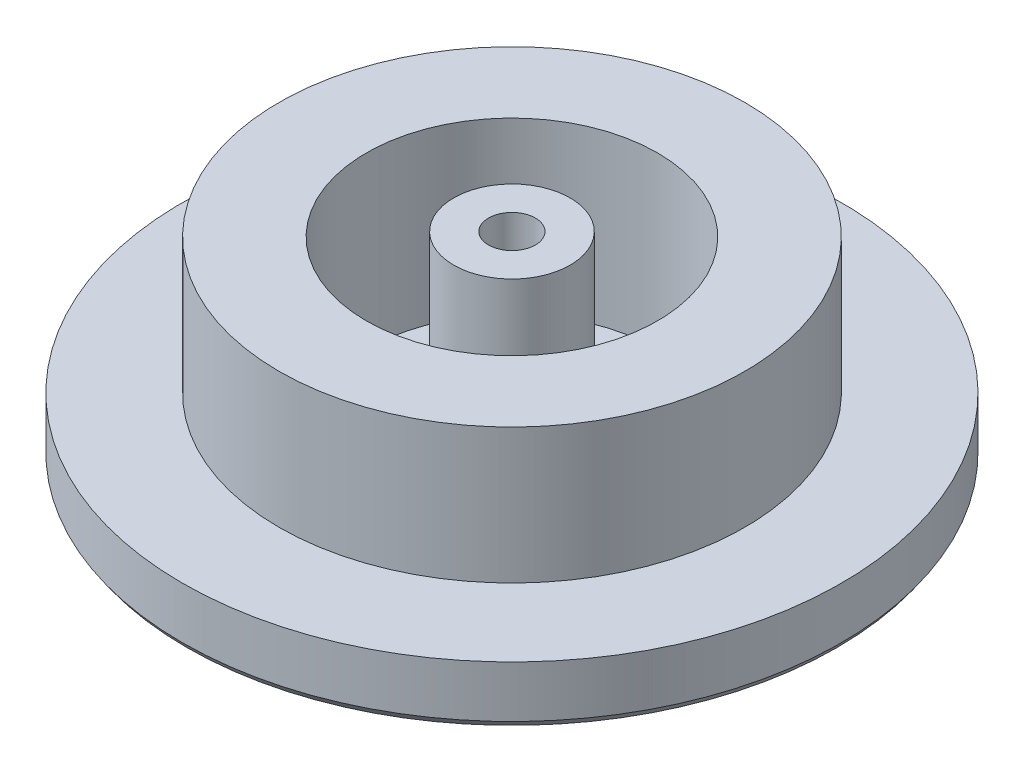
ISO-10303-21;
HEADER;
FILE_DESCRIPTION(('STEP AP214'),'2;1');
FILE_NAME('part.step','',(''),(''),'','','');
FILE_SCHEMA(('AUTOMOTIVE_DESIGN { 1 0 10303 214 1 1 1 1 }'));
ENDSEC;
DATA;
#1=APPLICATION_CONTEXT('core data for automotive mechanical design processes');
#2=APPLICATION_PROTOCOL_DEFINITION('international standard','automotive_design',2000,#1);
#3=PRODUCT_CONTEXT('',#1,'mechanical');
#4=PRODUCT('Part','Part','',(#3));
#5=PRODUCT_RELATED_PRODUCT_CATEGORY('part','',(#4));
#6=PRODUCT_DEFINITION_FORMATION('','',#4);
#7=PRODUCT_DEFINITION_CONTEXT('part definition',#1,'design');
#8=PRODUCT_DEFINITION('design','',#6,#7);
#9=PRODUCT_DEFINITION_SHAPE('','',#8);
#10=(LENGTH_UNIT() NAMED_UNIT(*) SI_UNIT(.MILLI.,.METRE.));
#11=(NAMED_UNIT(*) PLANE_ANGLE_UNIT() SI_UNIT($,.RADIAN.));
#12=(NAMED_UNIT(*) SI_UNIT($,.STERADIAN.) SOLID_ANGLE_UNIT());
#13=UNCERTAINTY_MEASURE_WITH_UNIT(LENGTH_MEASURE(1.E-05),#10,'distance_accuracy_value','');
#14=(GEOMETRIC_REPRESENTATION_CONTEXT(3) GLOBAL_UNCERTAINTY_ASSIGNED_CONTEXT((#13)) GLOBAL_UNIT_ASSIGNED_CONTEXT((#10,
#11,#12)) REPRESENTATION_CONTEXT('',''));
#15=CARTESIAN_POINT('',(0.,0.,0.));
#16=DIRECTION('',(0.,0.,1.));
#17=DIRECTION('',(1.,0.,0.));
#18=AXIS2_PLACEMENT_3D('',#15,#16,#17);
#19=CARTESIAN_POINT('',(0.,0.,0.));
#20=DIRECTION('',(0.,-1.,0.));
#21=DIRECTION('',(0.,0.,-1.));
#22=AXIS2_PLACEMENT_3D('',#19,#20,#21);
#23=PLANE('',#22);
#24=CARTESIAN_POINT('',(0.,0.,0.));
#25=DIRECTION('',(0.,1.,0.));
#26=DIRECTION('',(0.,0.,1.));
#27=AXIS2_PLACEMENT_3D('',#24,#25,#26);
#28=CIRCLE('',#27,2.5527);
#29=CARTESIAN_POINT('',(0.,0.,2.5527));
#30=VERTEX_POINT('',#29);
#31=EDGE_CURVE('E67',#30,#30,#28,.T.);
#32=ORIENTED_EDGE('',*,*,#31,.F.);
#33=EDGE_LOOP('',(#32));
#34=FACE_BOUND('',#33,.T.);
#35=CARTESIAN_POINT('',(0.,0.,0.));
#36=DIRECTION('',(0.,1.,0.));
#37=DIRECTION('',(0.,0.,1.));
#38=AXIS2_PLACEMENT_3D('',#35,#36,#37);
#39=CIRCLE('',#38,6.35);
#40=CARTESIAN_POINT('',(0.,0.,6.35));
#41=VERTEX_POINT('',#40);
#42=EDGE_CURVE('E97',#41,#41,#39,.T.);
#43=ORIENTED_EDGE('',*,*,#42,.T.);
#44=EDGE_LOOP('',(#43));
#45=FACE_BOUND('',#44,.T.);
#46=ADVANCED_FACE('F45',(#34,#45),#23,.F.);
#47=CARTESIAN_POINT('',(0.,5.76885173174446,0.));
#48=DIRECTION('',(0.,1.,0.));
#49=DIRECTION('',(0.,0.,1.));
#50=AXIS2_PLACEMENT_3D('',#47,#48,#49);
#51=CYLINDRICAL_SURFACE('',#50,6.35);
#52=ORIENTED_EDGE('',*,*,#42,.F.);
#53=EDGE_LOOP('',(#52));
#54=FACE_BOUND('',#53,.T.);
#55=CARTESIAN_POINT('',(0.,-19.05,0.));
#56=DIRECTION('',(0.,1.,0.));
#57=DIRECTION('',(0.,0.,1.));
#58=AXIS2_PLACEMENT_3D('',#55,#56,#57);
#59=CIRCLE('',#58,6.35);
#60=CARTESIAN_POINT('',(0.,-19.05,6.35));
#61=VERTEX_POINT('',#60);
#62=EDGE_CURVE('E93',#61,#61,#59,.T.);
#63=ORIENTED_EDGE('',*,*,#62,.T.);
#64=EDGE_LOOP('',(#63));
#65=FACE_BOUND('',#64,.T.);
#66=ADVANCED_FACE('F119',(#54,#65),#51,.T.);
#67=CARTESIAN_POINT('',(15.875,-19.05,0.));
#68=DIRECTION('',(0.,-1.,0.));
#69=DIRECTION('',(0.,0.,-1.));
#70=AXIS2_PLACEMENT_3D('',#67,#68,#69);
#71=PLANE('',#70);
#72=ORIENTED_EDGE('',*,*,#62,.F.);
#73=EDGE_LOOP('',(#72));
#74=FACE_BOUND('',#73,.T.);
#75=CARTESIAN_POINT('',(0.,-19.05,0.));
#76=DIRECTION('',(0.,1.,0.));
#77=DIRECTION('',(0.,0.,1.));
#78=AXIS2_PLACEMENT_3D('',#75,#76,#77);
#79=CIRCLE('',#78,15.875);
#80=CARTESIAN_POINT('',(0.,-19.05,15.875));
#81=VERTEX_POINT('',#80);
#82=EDGE_CURVE('E89',#81,#81,#79,.T.);
#83=ORIENTED_EDGE('',*,*,#82,.T.);
#84=EDGE_LOOP('',(#83));
#85=FACE_BOUND('',#84,.T.);
#86=ADVANCED_FACE('F124',(#74,#85),#71,.F.);
#87=CARTESIAN_POINT('',(0.,5.76885173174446,0.));
#88=DIRECTION('',(0.,1.,0.));
#89=DIRECTION('',(0.,0.,1.));
#90=AXIS2_PLACEMENT_3D('',#87,#88,#89);
#91=CYLINDRICAL_SURFACE('',#90,15.875);
#92=ORIENTED_EDGE('',*,*,#82,.F.);
#93=EDGE_LOOP('',(#92));
#94=FACE_BOUND('',#93,.T.);
#95=CARTESIAN_POINT('',(0.,-0.508000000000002,0.));
#96=DIRECTION('',(0.,1.,0.));
#97=DIRECTION('',(0.,0.,1.));
#98=AXIS2_PLACEMENT_3D('',#95,#96,#97);
#99=CIRCLE('',#98,15.875);
#100=CARTESIAN_POINT('',(0.,-0.508000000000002,15.875));
#101=VERTEX_POINT('',#100);
#102=EDGE_CURVE('E85',#101,#101,#99,.T.);
#103=ORIENTED_EDGE('',*,*,#102,.T.);
#104=EDGE_LOOP('',(#103));
#105=FACE_BOUND('',#104,.T.);
#106=ADVANCED_FACE('F132',(#94,#105),#91,.F.);
#107=CARTESIAN_POINT('',(25.4,-0.508000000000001,0.));
#108=DIRECTION('',(0.,-1.,0.));
#109=DIRECTION('',(0.,0.,-1.));
#110=AXIS2_PLACEMENT_3D('',#107,#108,#109);
#111=PLANE('',#110);
#112=ORIENTED_EDGE('',*,*,#102,.F.);
#113=EDGE_LOOP('',(#112));
#114=FACE_BOUND('',#113,.T.);
#115=CARTESIAN_POINT('',(0.,-0.508,0.));
#116=DIRECTION('',(0.,1.,0.));
#117=DIRECTION('',(0.,0.,1.));
#118=AXIS2_PLACEMENT_3D('',#115,#116,#117);
#119=CIRCLE('',#118,25.4);
#120=CARTESIAN_POINT('',(0.,-0.508,25.4));
#121=VERTEX_POINT('',#120);
#122=EDGE_CURVE('E81',#121,#121,#119,.T.);
#123=ORIENTED_EDGE('',*,*,#122,.T.);
#124=EDGE_LOOP('',(#123));
#125=FACE_BOUND('',#124,.T.);
#126=ADVANCED_FACE('F136',(#114,#125),#111,.F.);
#127=CARTESIAN_POINT('',(0.,5.76885173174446,0.));
#128=DIRECTION('',(0.,1.,0.));
#129=DIRECTION('',(0.,0.,1.));
#130=AXIS2_PLACEMENT_3D('',#127,#128,#129);
#131=CYLINDRICAL_SURFACE('',#130,25.4);
#132=ORIENTED_EDGE('',*,*,#122,.F.);
#133=EDGE_LOOP('',(#132));
#134=FACE_BOUND('',#133,.T.);
#135=CARTESIAN_POINT('',(0.,-15.24,0.));
#136=DIRECTION('',(0.,1.,0.));
#137=DIRECTION('',(0.,0.,1.));
#138=AXIS2_PLACEMENT_3D('',#135,#136,#137);
#139=CIRCLE('',#138,25.4);
#140=CARTESIAN_POINT('',(0.,-15.24,25.4));
#141=VERTEX_POINT('',#140);
#142=EDGE_CURVE('E77',#141,#141,#139,.T.);
#143=ORIENTED_EDGE('',*,*,#142,.T.);
#144=EDGE_LOOP('',(#143));
#145=FACE_BOUND('',#144,.T.);
#146=ADVANCED_FACE('F140',(#134,#145),#131,.T.);
#147=CARTESIAN_POINT('',(35.941,-15.24,0.));
#148=DIRECTION('',(0.,-1.,0.));
#149=DIRECTION('',(0.,0.,-1.));
#150=AXIS2_PLACEMENT_3D('',#147,#148,#149);
#151=PLANE('',#150);
#152=ORIENTED_EDGE('',*,*,#142,.F.);
#153=EDGE_LOOP('',(#152));
#154=FACE_BOUND('',#153,.T.);
#155=CARTESIAN_POINT('',(0.,-15.24,0.));
#156=DIRECTION('',(0.,1.,0.));
#157=DIRECTION('',(0.,0.,1.));
#158=AXIS2_PLACEMENT_3D('',#155,#156,#157);
#159=CIRCLE('',#158,35.941);
#160=CARTESIAN_POINT('',(0.,-15.24,35.941));
#161=VERTEX_POINT('',#160);
#162=EDGE_CURVE('E72',#161,#161,#159,.T.);
#163=ORIENTED_EDGE('',*,*,#162,.T.);
#164=EDGE_LOOP('',(#163));
#165=FACE_BOUND('',#164,.T.);
#166=ADVANCED_FACE('F144',(#154,#165),#151,.F.);
#167=CARTESIAN_POINT('',(0.,5.76885173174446,0.));
#168=DIRECTION('',(0.,1.,0.));
#169=DIRECTION('',(0.,0.,1.));
#170=AXIS2_PLACEMENT_3D('',#167,#168,#169);
#171=CYLINDRICAL_SURFACE('',#170,35.941);
#172=CARTESIAN_POINT('',(0.,-20.864500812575,0.));
#173=DIRECTION('',(0.,1.,0.));
#174=DIRECTION('',(0.,0.,1.));
#175=AXIS2_PLACEMENT_3D('',#172,#173,#174);
#176=CIRCLE('',#175,35.941);
#177=CARTESIAN_POINT('',(0.,-20.864500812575,35.941));
#178=VERTEX_POINT('',#177);
#179=EDGE_CURVE('E53',#178,#178,#176,.T.);
#180=ORIENTED_EDGE('',*,*,#179,.T.);
#181=EDGE_LOOP('',(#180));
#182=FACE_BOUND('',#181,.T.);
#183=ORIENTED_EDGE('',*,*,#162,.F.);
#184=EDGE_LOOP('',(#183));
#185=FACE_BOUND('',#184,.T.);
#186=ADVANCED_FACE('F104',(#182,#185),#171,.T.);
#187=CARTESIAN_POINT('',(0.,-21.59,0.));
#188=DIRECTION('',(0.,1.,0.));
#189=DIRECTION('',(0.,0.,1.));
#190=AXIS2_PLACEMENT_3D('',#187,#188,#189);
#191=PLANE('',#190);
#192=CARTESIAN_POINT('',(0.,-21.59,0.));
#193=DIRECTION('',(0.,1.,0.));
#194=DIRECTION('',(0.,0.,1.));
#195=AXIS2_PLACEMENT_3D('',#192,#193,#194);
#196=CIRCLE('',#195,35.433);
#197=CARTESIAN_POINT('',(0.,-21.59,35.433));
#198=VERTEX_POINT('',#197);
#199=EDGE_CURVE('E11',#198,#198,#196,.F.);
#200=ORIENTED_EDGE('',*,*,#199,.T.);
#201=EDGE_LOOP('',(#200));
#202=FACE_BOUND('',#201,.T.);
#203=ADVANCED_FACE('F108',(#202),#191,.F.);
#204=CARTESIAN_POINT('',(0.,-20.864500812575,0.));
#205=DIRECTION('',(0.,1.,0.));
#206=DIRECTION('',(0.,0.,1.));
#207=AXIS2_PLACEMENT_3D('',#204,#205,#206);
#208=CONICAL_SURFACE('',#207,35.941,0.610865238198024);
#209=ORIENTED_EDGE('',*,*,#199,.F.);
#210=EDGE_LOOP('',(#209));
#211=FACE_BOUND('',#210,.T.);
#212=ORIENTED_EDGE('',*,*,#179,.F.);
#213=EDGE_LOOP('',(#212));
#214=FACE_BOUND('',#213,.T.);
#215=ADVANCED_FACE('F47',(#211,#214),#208,.T.);
#216=CARTESIAN_POINT('',(0.,0.,0.));
#217=DIRECTION('',(0.,1.,0.));
#218=DIRECTION('',(0.,0.,1.));
#219=AXIS2_PLACEMENT_3D('',#216,#217,#218);
#220=CYLINDRICAL_SURFACE('',#219,2.5527);
#221=CARTESIAN_POINT('',(0.,-16.002,0.));
#222=DIRECTION('',(0.,1.,0.));
#223=DIRECTION('',(0.,0.,1.));
#224=AXIS2_PLACEMENT_3D('',#221,#222,#223);
#225=CIRCLE('',#224,2.5527);
#226=CARTESIAN_POINT('',(0.,-16.002,2.5527));
#227=VERTEX_POINT('',#226);
#228=EDGE_CURVE('E64',#227,#227,#225,.T.);
#229=ORIENTED_EDGE('',*,*,#228,.F.);
#230=EDGE_LOOP('',(#229));
#231=FACE_BOUND('',#230,.T.);
#232=ORIENTED_EDGE('',*,*,#31,.T.);
#233=EDGE_LOOP('',(#232));
#234=FACE_BOUND('',#233,.T.);
#235=ADVANCED_FACE('F60',(#231,#234),#220,.F.);
#236=CARTESIAN_POINT('',(0.,-16.002,0.));
#237=DIRECTION('',(0.,1.,0.));
#238=DIRECTION('',(0.,0.,1.));
#239=AXIS2_PLACEMENT_3D('',#236,#237,#238);
#240=CONICAL_SURFACE('',#239,2.5527,1.02974425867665);
#241=CARTESIAN_POINT('',(0.,-17.5358169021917,0.));
#242=VERTEX_POINT('',#241);
#243=VERTEX_LOOP('',#242);
#244=FACE_BOUND('',#243,.T.);
#245=ORIENTED_EDGE('',*,*,#228,.T.);
#246=EDGE_LOOP('',(#245));
#247=FACE_BOUND('',#246,.T.);
#248=ADVANCED_FACE('F57',(#244,#247),#240,.F.);
#249=CLOSED_SHELL('',(#46,#66,#86,#106,#126,#146,#166,#186,#203,#215,#235,#248));
#250=MANIFOLD_SOLID_BREP('B2',#249);
#251=ADVANCED_BREP_SHAPE_REPRESENTATION('',(#18,#250),#14);
#252=SHAPE_DEFINITION_REPRESENTATION(#9,#251);
ENDSEC;
END-ISO-10303-21;
